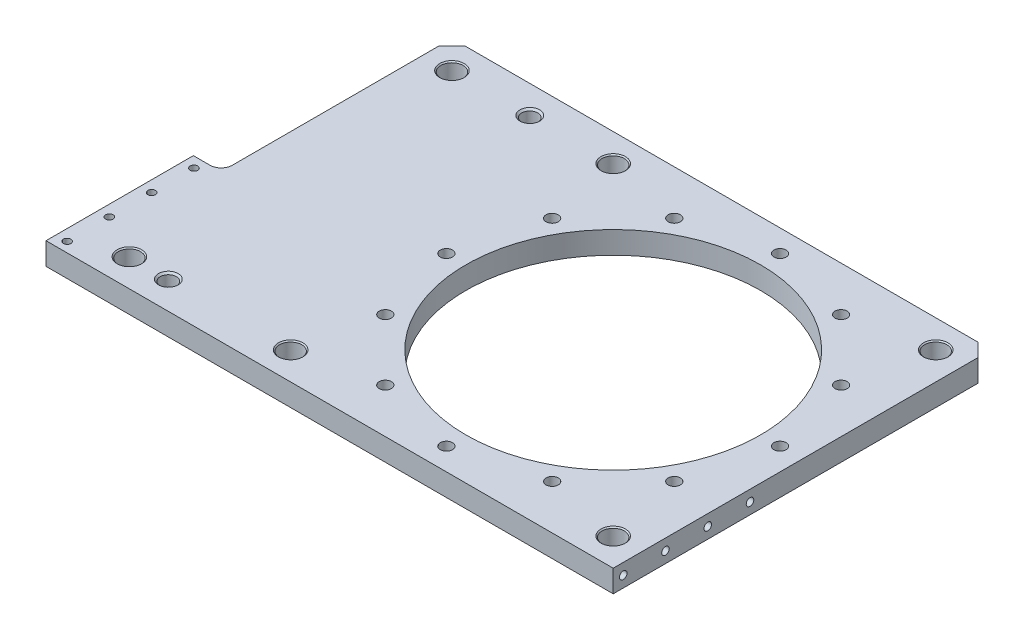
from build123d import *

# Parameters (mm, degrees)
SKETCH_1_W               = 485
SKETCH_1_H               = 340
SKETCH_1_R               = 132.5
EXTRUDE_1_DEPTH          = 20
HOLE_WIZARD_20_0_20_1_D  = 20
SKETCH_5_R               = 5.5
CUT_EXTRUDE_1_DEPTH      = 359.503835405
PATTERN_CIRCULAR_1_COUNT = 12
CHAMFER_1_SIZE           = 12
HOLE_WIZARD_M81_D        = 6.8
HOLE_WIZARD_M81_DEPTH    = 24
HOLE_WIZARD_M81_TIP      = 2.042926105
SKETCH_9_W               = 25
SKETCH_9_H               = 132.5
EXTRUDE_2_DEPTH          = 20
FILLET_1_R               = 10
HOLE_WIZARD_M82_D        = 6.8
CHAMFER_2_SIZE           = 1
M16X1_51_D               = 14.5
M16X1_51_CSINK_D         = 17.7
M16X1_51_CSINK_ANGLE     = 90


with BuildPart() as part:
    # Sketch 1 → Extrude 1 (new body)
    with BuildSketch(Plane(origin=(0, 0, 0), x_dir=(1, 0, 0), z_dir=(0, 1, 0))):
        with Locations((-72.5, 0)):
            Rectangle(SKETCH_1_W, SKETCH_1_H)
        with Locations(Location((0, 0, 0), (0, 0, 270))):
            Circle(SKETCH_1_R, mode=Mode.SUBTRACT)
    extrude(amount=EXTRUDE_1_DEPTH)

    # Hole Wizard 20.0 _20_1 (through all)
    with Locations(Plane(origin=(0, 20, 0), x_dir=(-1, 0, 0), z_dir=(0, 1, 0))):
        with Locations((145, -145), (-145, -145), (-145, 145), (145, 145), (290, -145), (290, 145)):
            Hole(HOLE_WIZARD_20_0_20_1_D / 2)

    # Sketch 5 → Cut-Extrude 1 (cut, through all)
    with BuildSketch(Plane(origin=(0, 20, 0), x_dir=(1, 0, 0), z_dir=(0, 1, 0))):
        with Locations(Location((-150, 0, 0), (0, 0, 270))):
            Circle(SKETCH_5_R)
    cut_extrude_1 = extrude(amount=-CUT_EXTRUDE_1_DEPTH, mode=Mode.SUBTRACT)

    # Pattern Circular 1: Cut-Extrude 1 ×12 about axis
    pattern_circular_1_axis = Axis((0, 0, 0), (0, 1, 0))
    for i in range(1, PATTERN_CIRCULAR_1_COUNT):
        add(cut_extrude_1.rotate(pattern_circular_1_axis, i * 360 / PATTERN_CIRCULAR_1_COUNT), mode=Mode.SUBTRACT)

    # Chamfer 1
    chamfer_1_edges = [part.edges().sort_by_distance(p)[0] for p in [
        (-315, 10, -170),
        (170, 10, -170),
    ]]
    chamfer(chamfer_1_edges, length=CHAMFER_1_SIZE)

    # Hole Wizard M81
    with Locations(Plane(origin=(170, 0, 0), x_dir=(0, 0, 1), z_dir=(1, 0, 0))):
        with Locations((161, -10), (47, -10), (85, -10), (123, -10)):
            Hole(HOLE_WIZARD_M81_D / 2, depth=HOLE_WIZARD_M81_DEPTH)
            with Locations((0, 0, -(HOLE_WIZARD_M81_DEPTH + HOLE_WIZARD_M81_TIP / 2))):  # 118° drill point
                Cone(0, HOLE_WIZARD_M81_D / 2, HOLE_WIZARD_M81_TIP, mode=Mode.SUBTRACT)

    # Sketch 9 → Extrude 2 (add)
    with BuildSketch(Plane.XZ):
        with Locations((-327.5, 103.75)):
            Rectangle(SKETCH_9_W, SKETCH_9_H)
    extrude(amount=-EXTRUDE_2_DEPTH)

    # Fillet 1
    fillet_1_edges = [part.edges().sort_by_distance(p)[0] for p in [
        (-315, 10, 37.5),
    ]]
    fillet(fillet_1_edges, radius=FILLET_1_R)

    # Hole Wizard M82 (through all)
    with Locations(Plane(origin=(0, 20, 0), x_dir=(1, 0, 0), z_dir=(0, 1, 0))):
        with Locations((-330, -161), (-330, -123), (-330, -85), (-330, -47)):
            Hole(HOLE_WIZARD_M82_D / 2)

    # Chamfer 2
    chamfer_2_edges = [part.edges().sort_by_distance(p)[0] for p in [
        (-300, 20, 145),
        (-300, 0, 145),
        (-300, 20, -145),
        (-300, 0, -145),
        (-155, 20, 145),
        (-155, 0, 145),
        (135, 20, 145),
        (135, 0, 145),
        (135, 20, -145),
        (135, 0, -145),
        (-155, 20, -145),
        (-155, 0, -145),
    ]]
    chamfer(chamfer_2_edges, length=CHAMFER_2_SIZE)

    # M16x1.51 (through all)
    with Locations(Plane(origin=(0, 20, 0), x_dir=(-1, 0, 0), z_dir=(0, 1, 0))):
        with Locations((220, -145), (255, 145)):
            CounterSinkHole(M16X1_51_D / 2, M16X1_51_CSINK_D / 2, counter_sink_angle=M16X1_51_CSINK_ANGLE)


solid = part.part
